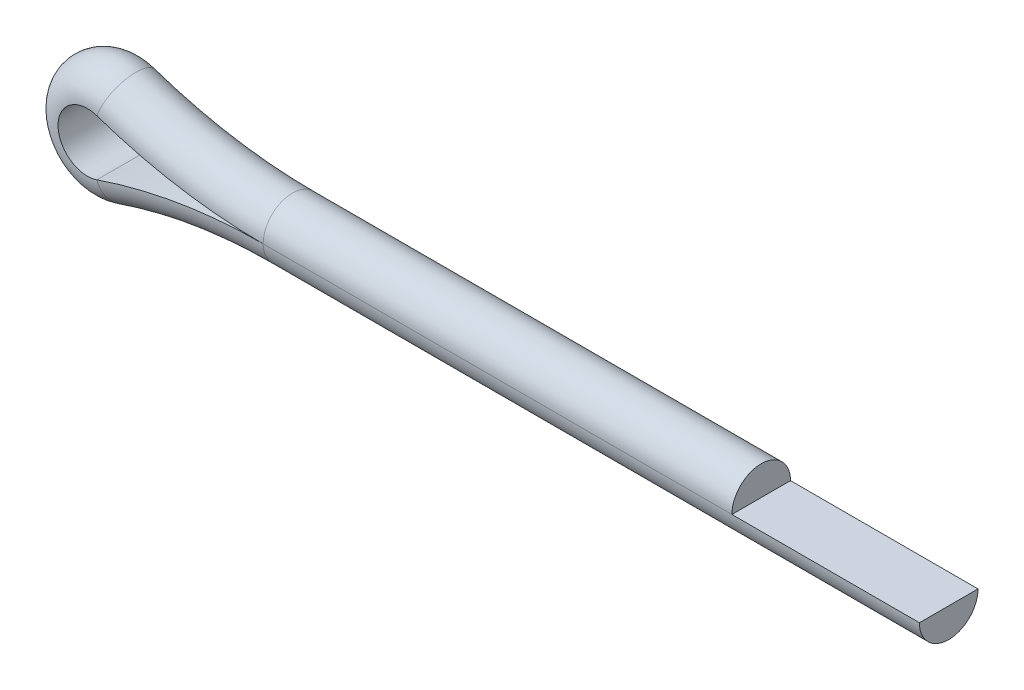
ISO-10303-21;
HEADER;
FILE_DESCRIPTION(('STEP AP214'),'2;1');
FILE_NAME('part.step','',(''),(''),'','','');
FILE_SCHEMA(('AUTOMOTIVE_DESIGN { 1 0 10303 214 1 1 1 1 }'));
ENDSEC;
DATA;
#1=APPLICATION_CONTEXT('core data for automotive mechanical design processes');
#2=APPLICATION_PROTOCOL_DEFINITION('international standard','automotive_design',2000,#1);
#3=PRODUCT_CONTEXT('',#1,'mechanical');
#4=PRODUCT('Part','Part','',(#3));
#5=PRODUCT_RELATED_PRODUCT_CATEGORY('part','',(#4));
#6=PRODUCT_DEFINITION_FORMATION('','',#4);
#7=PRODUCT_DEFINITION_CONTEXT('part definition',#1,'design');
#8=PRODUCT_DEFINITION('design','',#6,#7);
#9=PRODUCT_DEFINITION_SHAPE('','',#8);
#10=(LENGTH_UNIT() NAMED_UNIT(*) SI_UNIT(.MILLI.,.METRE.));
#11=(NAMED_UNIT(*) PLANE_ANGLE_UNIT() SI_UNIT($,.RADIAN.));
#12=(NAMED_UNIT(*) SI_UNIT($,.STERADIAN.) SOLID_ANGLE_UNIT());
#13=UNCERTAINTY_MEASURE_WITH_UNIT(LENGTH_MEASURE(1.E-05),#10,'distance_accuracy_value','');
#14=(GEOMETRIC_REPRESENTATION_CONTEXT(3) GLOBAL_UNCERTAINTY_ASSIGNED_CONTEXT((#13)) GLOBAL_UNIT_ASSIGNED_CONTEXT((#10,
#11,#12)) REPRESENTATION_CONTEXT('',''));
#15=CARTESIAN_POINT('',(0.,0.,0.));
#16=DIRECTION('',(0.,0.,1.));
#17=DIRECTION('',(1.,0.,0.));
#18=AXIS2_PLACEMENT_3D('',#15,#16,#17);
#19=CARTESIAN_POINT('',(2.,0.,-0.25));
#20=DIRECTION('',(0.,-1.,0.));
#21=DIRECTION('',(1.,0.,0.));
#22=AXIS2_PLACEMENT_3D('',#19,#20,#21);
#23=PLANE('',#22);
#24=DIRECTION('',(0.,0.,-1.));
#25=VECTOR('',#24,1.);
#26=CARTESIAN_POINT('',(2.,0.,-0.25));
#27=LINE('',#26,#25);
#28=CARTESIAN_POINT('',(2.,0.,0.25));
#29=VERTEX_POINT('',#28);
#30=CARTESIAN_POINT('',(2.,0.,-0.25));
#31=VERTEX_POINT('',#30);
#32=EDGE_CURVE('E137',#29,#31,#27,.T.);
#33=ORIENTED_EDGE('',*,*,#32,.F.);
#34=DIRECTION('',(1.,0.,0.));
#35=VECTOR('',#34,1.);
#36=CARTESIAN_POINT('',(2.,0.,0.25));
#37=LINE('',#36,#35);
#38=CARTESIAN_POINT('',(7.6,0.,0.25));
#39=VERTEX_POINT('',#38);
#40=EDGE_CURVE('E37',#29,#39,#37,.T.);
#41=ORIENTED_EDGE('',*,*,#40,.T.);
#42=DIRECTION('',(0.,0.,-1.));
#43=VECTOR('',#42,1.);
#44=CARTESIAN_POINT('',(7.6,0.,-0.25));
#45=LINE('',#44,#43);
#46=CARTESIAN_POINT('',(7.6,0.,-0.25));
#47=VERTEX_POINT('',#46);
#48=EDGE_CURVE('E44',#39,#47,#45,.T.);
#49=ORIENTED_EDGE('',*,*,#48,.T.);
#50=DIRECTION('',(1.,0.,0.));
#51=VECTOR('',#50,1.);
#52=CARTESIAN_POINT('',(2.,0.,-0.25));
#53=LINE('',#52,#51);
#54=EDGE_CURVE('E11',#31,#47,#53,.T.);
#55=ORIENTED_EDGE('',*,*,#54,.F.);
#56=EDGE_LOOP('',(#33,#41,#49,#55));
#57=FACE_BOUND('',#56,.T.);
#58=ADVANCED_FACE('F30',(#57),#23,.F.);
#59=CARTESIAN_POINT('',(2.,0.,0.));
#60=DIRECTION('',(1.,0.,0.));
#61=DIRECTION('',(0.,1.,0.));
#62=AXIS2_PLACEMENT_3D('',#59,#60,#61);
#63=CYLINDRICAL_SURFACE('',#62,0.25);
#64=CARTESIAN_POINT('',(2.,0.,0.));
#65=DIRECTION('',(-1.,0.,0.));
#66=DIRECTION('',(0.,0.,-1.));
#67=AXIS2_PLACEMENT_3D('',#64,#65,#66);
#68=CIRCLE('',#67,0.25);
#69=EDGE_CURVE('E134',#31,#29,#68,.T.);
#70=ORIENTED_EDGE('',*,*,#69,.F.);
#71=ORIENTED_EDGE('',*,*,#54,.T.);
#72=CARTESIAN_POINT('',(7.6,0.,0.));
#73=DIRECTION('',(-1.,0.,0.));
#74=DIRECTION('',(0.,0.,-1.));
#75=AXIS2_PLACEMENT_3D('',#72,#73,#74);
#76=CIRCLE('',#75,0.25);
#77=EDGE_CURVE('E50',#47,#39,#76,.T.);
#78=ORIENTED_EDGE('',*,*,#77,.T.);
#79=ORIENTED_EDGE('',*,*,#40,.F.);
#80=EDGE_LOOP('',(#70,#71,#78,#79));
#81=FACE_BOUND('',#80,.T.);
#82=ADVANCED_FACE('F149',(#81),#63,.T.);
#83=CARTESIAN_POINT('',(2.,-4.37499999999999,0.));
#84=DIRECTION('',(0.,0.,-1.));
#85=DIRECTION('',(-1.,0.,0.));
#86=AXIS2_PLACEMENT_3D('',#83,#84,#85);
#87=CYLINDRICAL_SURFACE('',#86,4.37499999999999);
#88=DIRECTION('',(0.,0.,-1.));
#89=VECTOR('',#88,1.);
#90=CARTESIAN_POINT('',(0.581081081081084,-0.236486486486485,-0.25));
#91=LINE('',#90,#89);
#92=CARTESIAN_POINT('',(0.581081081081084,-0.236486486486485,0.25));
#93=VERTEX_POINT('',#92);
#94=CARTESIAN_POINT('',(0.581081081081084,-0.236486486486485,-0.25));
#95=VERTEX_POINT('',#94);
#96=EDGE_CURVE('E125',#93,#95,#91,.T.);
#97=ORIENTED_EDGE('',*,*,#96,.F.);
#98=CARTESIAN_POINT('',(2.,-4.37499999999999,0.25));
#99=DIRECTION('',(0.,0.,-1.));
#100=DIRECTION('',(-1.,0.,0.));
#101=AXIS2_PLACEMENT_3D('',#98,#99,#100);
#102=CIRCLE('',#101,4.37499999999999);
#103=EDGE_CURVE('E140',#93,#29,#102,.T.);
#104=ORIENTED_EDGE('',*,*,#103,.T.);
#105=ORIENTED_EDGE('',*,*,#32,.T.);
#106=CARTESIAN_POINT('',(2.,-4.37499999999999,-0.25));
#107=DIRECTION('',(0.,0.,-1.));
#108=DIRECTION('',(-1.,0.,0.));
#109=AXIS2_PLACEMENT_3D('',#106,#107,#108);
#110=CIRCLE('',#109,4.37499999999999);
#111=EDGE_CURVE('E143',#95,#31,#110,.T.);
#112=ORIENTED_EDGE('',*,*,#111,.F.);
#113=EDGE_LOOP('',(#97,#104,#105,#112));
#114=FACE_BOUND('',#113,.T.);
#115=ADVANCED_FACE('F153',(#114),#87,.T.);
#116=CARTESIAN_POINT('',(2.,-4.37499999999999,0.));
#117=DIRECTION('',(0.,0.,-1.));
#118=DIRECTION('',(-1.,0.,0.));
#119=AXIS2_PLACEMENT_3D('',#116,#117,#118);
#120=TOROIDAL_SURFACE('',#119,4.37499999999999,0.25);
#121=CARTESIAN_POINT('',(0.581081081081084,-0.236486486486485,0.));
#122=DIRECTION('',(-0.945945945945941,-0.324324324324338,0.));
#123=DIRECTION('',(0.,0.,-1.));
#124=AXIS2_PLACEMENT_3D('',#121,#122,#123);
#125=CIRCLE('',#124,0.25);
#126=EDGE_CURVE('E122',#95,#93,#125,.T.);
#127=ORIENTED_EDGE('',*,*,#126,.F.);
#128=ORIENTED_EDGE('',*,*,#111,.T.);
#129=ORIENTED_EDGE('',*,*,#69,.T.);
#130=ORIENTED_EDGE('',*,*,#103,.F.);
#131=EDGE_LOOP('',(#127,#128,#129,#130));
#132=FACE_BOUND('',#131,.T.);
#133=ADVANCED_FACE('F155',(#132),#120,.T.);
#134=CARTESIAN_POINT('',(0.5,0.,0.));
#135=DIRECTION('',(0.,0.,1.));
#136=DIRECTION('',(1.,0.,0.));
#137=AXIS2_PLACEMENT_3D('',#134,#135,#136);
#138=CYLINDRICAL_SURFACE('',#137,0.249999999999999);
#139=DIRECTION('',(0.,0.,-1.));
#140=VECTOR('',#139,1.);
#141=CARTESIAN_POINT('',(0.581081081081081,0.236486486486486,-0.25));
#142=LINE('',#141,#140);
#143=CARTESIAN_POINT('',(0.581081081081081,0.236486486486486,0.25));
#144=VERTEX_POINT('',#143);
#145=CARTESIAN_POINT('',(0.581081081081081,0.236486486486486,-0.25));
#146=VERTEX_POINT('',#145);
#147=EDGE_CURVE('E94',#144,#146,#142,.T.);
#148=ORIENTED_EDGE('',*,*,#147,.F.);
#149=CARTESIAN_POINT('',(0.5,0.,0.25));
#150=DIRECTION('',(0.,0.,1.));
#151=DIRECTION('',(1.,0.,0.));
#152=AXIS2_PLACEMENT_3D('',#149,#150,#151);
#153=CIRCLE('',#152,0.249999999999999);
#154=EDGE_CURVE('E128',#144,#93,#153,.T.);
#155=ORIENTED_EDGE('',*,*,#154,.T.);
#156=ORIENTED_EDGE('',*,*,#96,.T.);
#157=CARTESIAN_POINT('',(0.5,0.,-0.25));
#158=DIRECTION('',(0.,0.,1.));
#159=DIRECTION('',(1.,0.,0.));
#160=AXIS2_PLACEMENT_3D('',#157,#158,#159);
#161=CIRCLE('',#160,0.249999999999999);
#162=EDGE_CURVE('E131',#146,#95,#161,.T.);
#163=ORIENTED_EDGE('',*,*,#162,.F.);
#164=EDGE_LOOP('',(#148,#155,#156,#163));
#165=FACE_BOUND('',#164,.T.);
#166=ADVANCED_FACE('F159',(#165),#138,.F.);
#167=CARTESIAN_POINT('',(0.5,0.,0.));
#168=DIRECTION('',(0.,0.,1.));
#169=DIRECTION('',(1.,0.,0.));
#170=AXIS2_PLACEMENT_3D('',#167,#168,#169);
#171=DEGENERATE_TOROIDAL_SURFACE('',#170,0.249999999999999,0.25,.T.);
#172=CARTESIAN_POINT('',(0.581081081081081,0.236486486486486,0.));
#173=DIRECTION('',(0.945945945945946,-0.324324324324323,0.));
#174=DIRECTION('',(0.,0.,-1.));
#175=AXIS2_PLACEMENT_3D('',#172,#173,#174);
#176=CIRCLE('',#175,0.25);
#177=EDGE_CURVE('E90',#146,#144,#176,.T.);
#178=ORIENTED_EDGE('',*,*,#177,.F.);
#179=ORIENTED_EDGE('',*,*,#162,.T.);
#180=ORIENTED_EDGE('',*,*,#126,.T.);
#181=ORIENTED_EDGE('',*,*,#154,.F.);
#182=EDGE_LOOP('',(#178,#179,#180,#181));
#183=FACE_BOUND('',#182,.T.);
#184=ADVANCED_FACE('F160',(#183),#171,.T.);
#185=CARTESIAN_POINT('',(2.,4.37500000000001,0.));
#186=DIRECTION('',(0.,0.,-1.));
#187=DIRECTION('',(-1.,0.,0.));
#188=AXIS2_PLACEMENT_3D('',#185,#186,#187);
#189=CYLINDRICAL_SURFACE('',#188,4.37500000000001);
#190=DIRECTION('',(0.,0.,-1.));
#191=VECTOR('',#190,1.);
#192=CARTESIAN_POINT('',(2.,0.,-0.25));
#193=LINE('',#192,#191);
#194=CARTESIAN_POINT('',(2.,0.,0.25));
#195=VERTEX_POINT('',#194);
#196=CARTESIAN_POINT('',(2.,0.,-0.25));
#197=VERTEX_POINT('',#196);
#198=EDGE_CURVE('E97',#195,#197,#193,.T.);
#199=ORIENTED_EDGE('',*,*,#198,.F.);
#200=CARTESIAN_POINT('',(2.,4.37500000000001,0.25));
#201=DIRECTION('',(0.,0.,-1.));
#202=DIRECTION('',(-1.,0.,0.));
#203=AXIS2_PLACEMENT_3D('',#200,#201,#202);
#204=CIRCLE('',#203,4.37500000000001);
#205=EDGE_CURVE('E82',#195,#144,#204,.T.);
#206=ORIENTED_EDGE('',*,*,#205,.T.);
#207=ORIENTED_EDGE('',*,*,#147,.T.);
#208=CARTESIAN_POINT('',(2.,4.37500000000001,-0.25));
#209=DIRECTION('',(0.,0.,-1.));
#210=DIRECTION('',(-1.,0.,0.));
#211=AXIS2_PLACEMENT_3D('',#208,#209,#210);
#212=CIRCLE('',#211,4.37500000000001);
#213=EDGE_CURVE('E93',#197,#146,#212,.T.);
#214=ORIENTED_EDGE('',*,*,#213,.F.);
#215=EDGE_LOOP('',(#199,#206,#207,#214));
#216=FACE_BOUND('',#215,.T.);
#217=ADVANCED_FACE('F99',(#216),#189,.T.);
#218=CARTESIAN_POINT('',(2.,4.37500000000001,0.));
#219=DIRECTION('',(0.,0.,-1.));
#220=DIRECTION('',(-1.,0.,0.));
#221=AXIS2_PLACEMENT_3D('',#218,#219,#220);
#222=TOROIDAL_SURFACE('',#221,4.37500000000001,0.25);
#223=CARTESIAN_POINT('',(2.,0.,0.));
#224=DIRECTION('',(1.,0.,0.));
#225=DIRECTION('',(0.,0.,-1.));
#226=AXIS2_PLACEMENT_3D('',#223,#224,#225);
#227=CIRCLE('',#226,0.25);
#228=EDGE_CURVE('E87',#197,#195,#227,.T.);
#229=ORIENTED_EDGE('',*,*,#228,.F.);
#230=ORIENTED_EDGE('',*,*,#213,.T.);
#231=ORIENTED_EDGE('',*,*,#177,.T.);
#232=ORIENTED_EDGE('',*,*,#205,.F.);
#233=EDGE_LOOP('',(#229,#230,#231,#232));
#234=FACE_BOUND('',#233,.T.);
#235=ADVANCED_FACE('F84',(#234),#222,.T.);
#236=CARTESIAN_POINT('',(2.,0.,0.));
#237=DIRECTION('',(1.,0.,0.));
#238=DIRECTION('',(0.,1.,0.));
#239=AXIS2_PLACEMENT_3D('',#236,#237,#238);
#240=CYLINDRICAL_SURFACE('',#239,0.25);
#241=CARTESIAN_POINT('',(6.,0.,0.));
#242=DIRECTION('',(1.,0.,0.));
#243=DIRECTION('',(0.,0.,-1.));
#244=AXIS2_PLACEMENT_3D('',#241,#242,#243);
#245=CIRCLE('',#244,0.25);
#246=CARTESIAN_POINT('',(6.,0.,-0.25));
#247=VERTEX_POINT('',#246);
#248=CARTESIAN_POINT('',(6.,0.,0.25));
#249=VERTEX_POINT('',#248);
#250=EDGE_CURVE('E114',#247,#249,#245,.T.);
#251=ORIENTED_EDGE('',*,*,#250,.F.);
#252=DIRECTION('',(1.,0.,0.));
#253=VECTOR('',#252,1.);
#254=CARTESIAN_POINT('',(2.,0.,-0.25));
#255=LINE('',#254,#253);
#256=EDGE_CURVE('E110',#197,#247,#255,.T.);
#257=ORIENTED_EDGE('',*,*,#256,.F.);
#258=ORIENTED_EDGE('',*,*,#228,.T.);
#259=DIRECTION('',(1.,0.,0.));
#260=VECTOR('',#259,1.);
#261=CARTESIAN_POINT('',(2.,0.,0.25));
#262=LINE('',#261,#260);
#263=EDGE_CURVE('E101',#195,#249,#262,.T.);
#264=ORIENTED_EDGE('',*,*,#263,.T.);
#265=EDGE_LOOP('',(#251,#257,#258,#264));
#266=FACE_BOUND('',#265,.T.);
#267=ADVANCED_FACE('F112',(#266),#240,.T.);
#268=CARTESIAN_POINT('',(2.,0.,-0.25));
#269=DIRECTION('',(0.,-1.,0.));
#270=DIRECTION('',(1.,0.,0.));
#271=AXIS2_PLACEMENT_3D('',#268,#269,#270);
#272=PLANE('',#271);
#273=DIRECTION('',(0.,0.,-1.));
#274=VECTOR('',#273,1.);
#275=CARTESIAN_POINT('',(6.,0.,-0.25));
#276=LINE('',#275,#274);
#277=EDGE_CURVE('E106',#249,#247,#276,.T.);
#278=ORIENTED_EDGE('',*,*,#277,.F.);
#279=ORIENTED_EDGE('',*,*,#263,.F.);
#280=ORIENTED_EDGE('',*,*,#198,.T.);
#281=ORIENTED_EDGE('',*,*,#256,.T.);
#282=EDGE_LOOP('',(#278,#279,#280,#281));
#283=FACE_BOUND('',#282,.T.);
#284=ADVANCED_FACE('F104',(#283),#272,.T.);
#285=CARTESIAN_POINT('',(7.6,0.,0.));
#286=DIRECTION('',(-1.,0.,0.));
#287=DIRECTION('',(0.,0.,-1.));
#288=AXIS2_PLACEMENT_3D('',#285,#286,#287);
#289=PLANE('',#288);
#290=ORIENTED_EDGE('',*,*,#77,.F.);
#291=ORIENTED_EDGE('',*,*,#48,.F.);
#292=EDGE_LOOP('',(#290,#291));
#293=FACE_BOUND('',#292,.T.);
#294=ADVANCED_FACE('F222',(#293),#289,.F.);
#295=CARTESIAN_POINT('',(6.,0.,0.));
#296=DIRECTION('',(1.,0.,0.));
#297=DIRECTION('',(0.,0.,-1.));
#298=AXIS2_PLACEMENT_3D('',#295,#296,#297);
#299=PLANE('',#298);
#300=ORIENTED_EDGE('',*,*,#250,.T.);
#301=ORIENTED_EDGE('',*,*,#277,.T.);
#302=EDGE_LOOP('',(#300,#301));
#303=FACE_BOUND('',#302,.T.);
#304=ADVANCED_FACE('F231',(#303),#299,.T.);
#305=CLOSED_SHELL('',(#58,#82,#115,#133,#166,#184,#217,#235,#267,#284,#294,#304));
#306=MANIFOLD_SOLID_BREP('B2',#305);
#307=ADVANCED_BREP_SHAPE_REPRESENTATION('',(#18,#306),#14);
#308=SHAPE_DEFINITION_REPRESENTATION(#9,#307);
ENDSEC;
END-ISO-10303-21;
